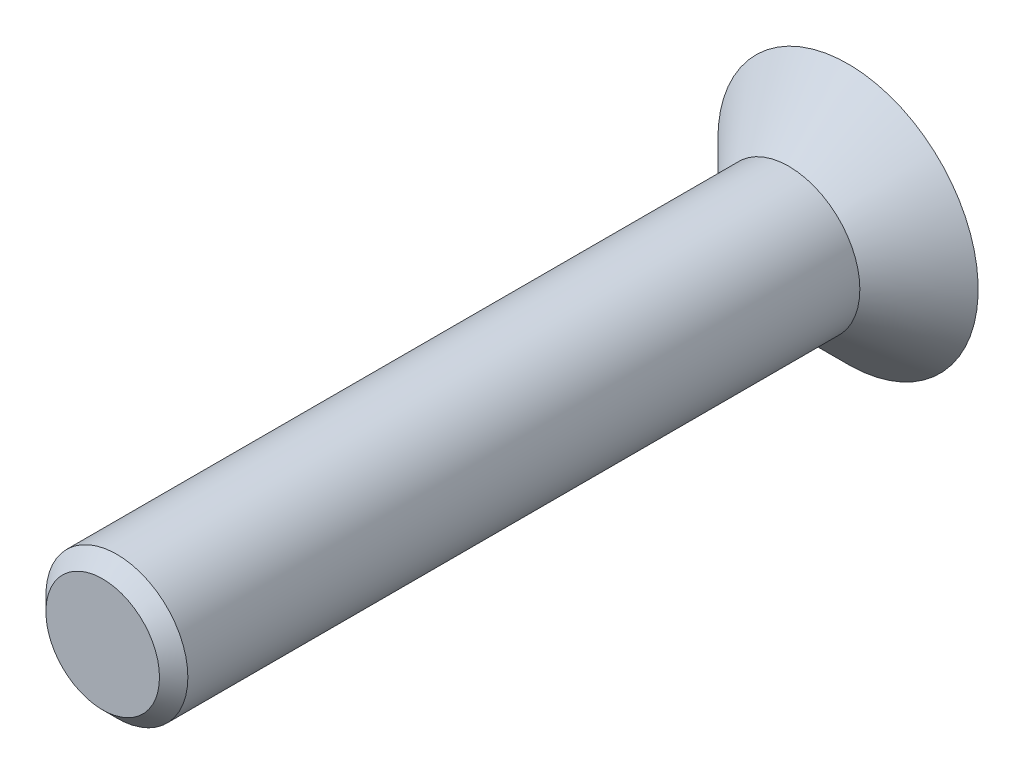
ISO-10303-21;
HEADER;
FILE_DESCRIPTION(('STEP AP214'),'2;1');
FILE_NAME('part.step','',(''),(''),'','','');
FILE_SCHEMA(('AUTOMOTIVE_DESIGN { 1 0 10303 214 1 1 1 1 }'));
ENDSEC;
DATA;
#1=APPLICATION_CONTEXT('core data for automotive mechanical design processes');
#2=APPLICATION_PROTOCOL_DEFINITION('international standard','automotive_design',2000,#1);
#3=PRODUCT_CONTEXT('',#1,'mechanical');
#4=PRODUCT('Part','Part','',(#3));
#5=PRODUCT_RELATED_PRODUCT_CATEGORY('part','',(#4));
#6=PRODUCT_DEFINITION_FORMATION('','',#4);
#7=PRODUCT_DEFINITION_CONTEXT('part definition',#1,'design');
#8=PRODUCT_DEFINITION('design','',#6,#7);
#9=PRODUCT_DEFINITION_SHAPE('','',#8);
#10=(LENGTH_UNIT() NAMED_UNIT(*) SI_UNIT(.MILLI.,.METRE.));
#11=(NAMED_UNIT(*) PLANE_ANGLE_UNIT() SI_UNIT($,.RADIAN.));
#12=(NAMED_UNIT(*) SI_UNIT($,.STERADIAN.) SOLID_ANGLE_UNIT());
#13=UNCERTAINTY_MEASURE_WITH_UNIT(LENGTH_MEASURE(1.E-05),#10,'distance_accuracy_value','');
#14=(GEOMETRIC_REPRESENTATION_CONTEXT(3) GLOBAL_UNCERTAINTY_ASSIGNED_CONTEXT((#13)) GLOBAL_UNIT_ASSIGNED_CONTEXT((#10,
#11,#12)) REPRESENTATION_CONTEXT('',''));
#15=CARTESIAN_POINT('',(0.,0.,0.));
#16=DIRECTION('',(0.,0.,1.));
#17=DIRECTION('',(1.,0.,0.));
#18=AXIS2_PLACEMENT_3D('',#15,#16,#17);
#19=CARTESIAN_POINT('',(0.,0.,-1.25));
#20=DIRECTION('',(0.,0.,1.));
#21=DIRECTION('',(1.,0.,0.));
#22=AXIS2_PLACEMENT_3D('',#19,#20,#21);
#23=PLANE('',#22);
#24=CARTESIAN_POINT('',(0.,0.,-1.25));
#25=DIRECTION('',(0.,0.,-1.));
#26=DIRECTION('',(-1.,0.,0.));
#27=AXIS2_PLACEMENT_3D('',#24,#25,#26);
#28=CIRCLE('',#27,2.75);
#29=CARTESIAN_POINT('',(-2.75,0.,-1.25));
#30=VERTEX_POINT('',#29);
#31=EDGE_CURVE('E84',#30,#30,#28,.T.);
#32=ORIENTED_EDGE('',*,*,#31,.T.);
#33=EDGE_LOOP('',(#32));
#34=FACE_BOUND('',#33,.T.);
#35=DIRECTION('',(-0.86602540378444,0.499999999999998,0.));
#36=VECTOR('',#35,1.);
#37=CARTESIAN_POINT('',(0.,1.15470053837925,-1.25));
#38=LINE('',#37,#36);
#39=CARTESIAN_POINT('',(1.,0.577350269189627,-1.25));
#40=VERTEX_POINT('',#39);
#41=CARTESIAN_POINT('',(0.,1.15470053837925,-1.25));
#42=VERTEX_POINT('',#41);
#43=EDGE_CURVE('E41',#40,#42,#38,.T.);
#44=ORIENTED_EDGE('',*,*,#43,.T.);
#45=DIRECTION('',(-0.866025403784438,-0.500000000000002,0.));
#46=VECTOR('',#45,1.);
#47=CARTESIAN_POINT('',(-1.,0.577350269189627,-1.25));
#48=LINE('',#47,#46);
#49=CARTESIAN_POINT('',(-1.,0.577350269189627,-1.25));
#50=VERTEX_POINT('',#49);
#51=EDGE_CURVE('E141',#42,#50,#48,.T.);
#52=ORIENTED_EDGE('',*,*,#51,.T.);
#53=DIRECTION('',(0.,-1.,0.));
#54=VECTOR('',#53,1.);
#55=CARTESIAN_POINT('',(-1.,-0.577350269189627,-1.25));
#56=LINE('',#55,#54);
#57=CARTESIAN_POINT('',(-1.,-0.577350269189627,-1.25));
#58=VERTEX_POINT('',#57);
#59=EDGE_CURVE('E144',#50,#58,#56,.T.);
#60=ORIENTED_EDGE('',*,*,#59,.T.);
#61=DIRECTION('',(0.866025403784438,-0.500000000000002,0.));
#62=VECTOR('',#61,1.);
#63=CARTESIAN_POINT('',(-1.,-0.577350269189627,-1.25));
#64=LINE('',#63,#62);
#65=CARTESIAN_POINT('',(0.,-1.15470053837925,-1.25));
#66=VERTEX_POINT('',#65);
#67=EDGE_CURVE('E150',#58,#66,#64,.T.);
#68=ORIENTED_EDGE('',*,*,#67,.T.);
#69=DIRECTION('',(0.86602540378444,0.499999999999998,0.));
#70=VECTOR('',#69,1.);
#71=CARTESIAN_POINT('',(0.,-1.15470053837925,-1.25));
#72=LINE('',#71,#70);
#73=CARTESIAN_POINT('',(1.,-0.577350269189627,-1.25));
#74=VERTEX_POINT('',#73);
#75=EDGE_CURVE('E153',#66,#74,#72,.T.);
#76=ORIENTED_EDGE('',*,*,#75,.T.);
#77=DIRECTION('',(0.,1.,0.));
#78=VECTOR('',#77,1.);
#79=CARTESIAN_POINT('',(1.,-0.577350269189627,-1.25));
#80=LINE('',#79,#78);
#81=EDGE_CURVE('E90',#74,#40,#80,.T.);
#82=ORIENTED_EDGE('',*,*,#81,.T.);
#83=EDGE_LOOP('',(#44,#52,#60,#68,#76,#82));
#84=FACE_BOUND('',#83,.T.);
#85=ADVANCED_FACE('F27',(#34,#84),#23,.F.);
#86=CARTESIAN_POINT('',(0.,0.,0.));
#87=DIRECTION('',(0.,0.,-1.));
#88=DIRECTION('',(-1.,0.,0.));
#89=AXIS2_PLACEMENT_3D('',#86,#87,#88);
#90=CONICAL_SURFACE('',#89,1.5,0.78539816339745);
#91=ORIENTED_EDGE('',*,*,#31,.F.);
#92=EDGE_LOOP('',(#91));
#93=FACE_BOUND('',#92,.T.);
#94=CARTESIAN_POINT('',(0.,0.,0.));
#95=DIRECTION('',(0.,0.,1.));
#96=DIRECTION('',(1.,0.,0.));
#97=AXIS2_PLACEMENT_3D('',#94,#95,#96);
#98=CIRCLE('',#97,1.5);
#99=CARTESIAN_POINT('',(1.5,0.,0.));
#100=VERTEX_POINT('',#99);
#101=EDGE_CURVE('E142',#100,#100,#98,.T.);
#102=ORIENTED_EDGE('',*,*,#101,.F.);
#103=EDGE_LOOP('',(#102));
#104=FACE_BOUND('',#103,.T.);
#105=ADVANCED_FACE('F128',(#93,#104),#90,.T.);
#106=CARTESIAN_POINT('',(0.,1.15470053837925,3.55));
#107=DIRECTION('',(-0.499999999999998,-0.86602540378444,0.));
#108=DIRECTION('',(0.86602540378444,-0.499999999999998,0.));
#109=AXIS2_PLACEMENT_3D('',#106,#107,#108);
#110=PLANE('',#109);
#111=DIRECTION('',(-0.86602540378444,0.499999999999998,0.));
#112=VECTOR('',#111,1.);
#113=CARTESIAN_POINT('',(0.499999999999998,0.86602540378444,0.));
#114=LINE('',#113,#112);
#115=CARTESIAN_POINT('',(1.,0.577350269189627,0.));
#116=VERTEX_POINT('',#115);
#117=CARTESIAN_POINT('',(0.,1.15470053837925,0.));
#118=VERTEX_POINT('',#117);
#119=EDGE_CURVE('E49',#116,#118,#114,.T.);
#120=ORIENTED_EDGE('',*,*,#119,.T.);
#121=DIRECTION('',(0.,0.,-1.));
#122=VECTOR('',#121,1.);
#123=CARTESIAN_POINT('',(0.,1.15470053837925,3.55));
#124=LINE('',#123,#122);
#125=EDGE_CURVE('E162',#118,#42,#124,.T.);
#126=ORIENTED_EDGE('',*,*,#125,.T.);
#127=ORIENTED_EDGE('',*,*,#43,.F.);
#128=DIRECTION('',(0.,0.,-1.));
#129=VECTOR('',#128,1.);
#130=CARTESIAN_POINT('',(1.,0.577350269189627,3.55));
#131=LINE('',#130,#129);
#132=EDGE_CURVE('E95',#116,#40,#131,.T.);
#133=ORIENTED_EDGE('',*,*,#132,.F.);
#134=EDGE_LOOP('',(#120,#126,#127,#133));
#135=FACE_BOUND('',#134,.T.);
#136=ADVANCED_FACE('F133',(#135),#110,.T.);
#137=CARTESIAN_POINT('',(-1.,0.577350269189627,3.55));
#138=DIRECTION('',(0.500000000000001,-0.866025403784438,0.));
#139=DIRECTION('',(0.866025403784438,0.500000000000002,0.));
#140=AXIS2_PLACEMENT_3D('',#137,#138,#139);
#141=PLANE('',#140);
#142=DIRECTION('',(-0.866025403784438,-0.500000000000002,0.));
#143=VECTOR('',#142,1.);
#144=CARTESIAN_POINT('',(-0.500000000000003,0.86602540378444,0.));
#145=LINE('',#144,#143);
#146=CARTESIAN_POINT('',(-1.,0.577350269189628,0.));
#147=VERTEX_POINT('',#146);
#148=EDGE_CURVE('E107',#118,#147,#145,.T.);
#149=ORIENTED_EDGE('',*,*,#148,.T.);
#150=DIRECTION('',(0.,0.,-1.));
#151=VECTOR('',#150,1.);
#152=CARTESIAN_POINT('',(-1.,0.577350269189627,3.55));
#153=LINE('',#152,#151);
#154=EDGE_CURVE('E160',#147,#50,#153,.T.);
#155=ORIENTED_EDGE('',*,*,#154,.T.);
#156=ORIENTED_EDGE('',*,*,#51,.F.);
#157=ORIENTED_EDGE('',*,*,#125,.F.);
#158=EDGE_LOOP('',(#149,#155,#156,#157));
#159=FACE_BOUND('',#158,.T.);
#160=ADVANCED_FACE('F165',(#159),#141,.T.);
#161=CARTESIAN_POINT('',(-1.,-0.577350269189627,3.55));
#162=DIRECTION('',(1.,0.,0.));
#163=DIRECTION('',(0.,0.,-1.));
#164=AXIS2_PLACEMENT_3D('',#161,#162,#163);
#165=PLANE('',#164);
#166=DIRECTION('',(0.,-1.,0.));
#167=VECTOR('',#166,1.);
#168=CARTESIAN_POINT('',(-1.,0.,0.));
#169=LINE('',#168,#167);
#170=CARTESIAN_POINT('',(-1.,-0.577350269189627,0.));
#171=VERTEX_POINT('',#170);
#172=EDGE_CURVE('E101',#147,#171,#169,.T.);
#173=ORIENTED_EDGE('',*,*,#172,.T.);
#174=DIRECTION('',(0.,0.,-1.));
#175=VECTOR('',#174,1.);
#176=CARTESIAN_POINT('',(-1.,-0.577350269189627,3.55));
#177=LINE('',#176,#175);
#178=EDGE_CURVE('E158',#171,#58,#177,.T.);
#179=ORIENTED_EDGE('',*,*,#178,.T.);
#180=ORIENTED_EDGE('',*,*,#59,.F.);
#181=ORIENTED_EDGE('',*,*,#154,.F.);
#182=EDGE_LOOP('',(#173,#179,#180,#181));
#183=FACE_BOUND('',#182,.T.);
#184=ADVANCED_FACE('F169',(#183),#165,.T.);
#185=CARTESIAN_POINT('',(-1.,-0.577350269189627,3.55));
#186=DIRECTION('',(0.500000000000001,0.866025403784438,0.));
#187=DIRECTION('',(-0.866025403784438,0.500000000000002,0.));
#188=AXIS2_PLACEMENT_3D('',#185,#186,#187);
#189=PLANE('',#188);
#190=DIRECTION('',(0.866025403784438,-0.500000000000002,0.));
#191=VECTOR('',#190,1.);
#192=CARTESIAN_POINT('',(-0.500000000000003,-0.86602540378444,0.));
#193=LINE('',#192,#191);
#194=CARTESIAN_POINT('',(0.,-1.15470053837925,0.));
#195=VERTEX_POINT('',#194);
#196=EDGE_CURVE('E99',#171,#195,#193,.T.);
#197=ORIENTED_EDGE('',*,*,#196,.T.);
#198=DIRECTION('',(0.,0.,-1.));
#199=VECTOR('',#198,1.);
#200=CARTESIAN_POINT('',(0.,-1.15470053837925,3.55));
#201=LINE('',#200,#199);
#202=EDGE_CURVE('E94',#195,#66,#201,.T.);
#203=ORIENTED_EDGE('',*,*,#202,.T.);
#204=ORIENTED_EDGE('',*,*,#67,.F.);
#205=ORIENTED_EDGE('',*,*,#178,.F.);
#206=EDGE_LOOP('',(#197,#203,#204,#205));
#207=FACE_BOUND('',#206,.T.);
#208=ADVANCED_FACE('F173',(#207),#189,.T.);
#209=CARTESIAN_POINT('',(0.,-1.15470053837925,3.55));
#210=DIRECTION('',(-0.499999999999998,0.86602540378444,0.));
#211=DIRECTION('',(-0.86602540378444,-0.499999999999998,0.));
#212=AXIS2_PLACEMENT_3D('',#209,#210,#211);
#213=PLANE('',#212);
#214=DIRECTION('',(0.86602540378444,0.499999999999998,0.));
#215=VECTOR('',#214,1.);
#216=CARTESIAN_POINT('',(0.499999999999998,-0.86602540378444,0.));
#217=LINE('',#216,#215);
#218=CARTESIAN_POINT('',(1.,-0.577350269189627,0.));
#219=VERTEX_POINT('',#218);
#220=EDGE_CURVE('E81',#195,#219,#217,.T.);
#221=ORIENTED_EDGE('',*,*,#220,.T.);
#222=DIRECTION('',(0.,0.,-1.));
#223=VECTOR('',#222,1.);
#224=CARTESIAN_POINT('',(1.,-0.577350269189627,3.55));
#225=LINE('',#224,#223);
#226=EDGE_CURVE('E87',#219,#74,#225,.T.);
#227=ORIENTED_EDGE('',*,*,#226,.T.);
#228=ORIENTED_EDGE('',*,*,#75,.F.);
#229=ORIENTED_EDGE('',*,*,#202,.F.);
#230=EDGE_LOOP('',(#221,#227,#228,#229));
#231=FACE_BOUND('',#230,.T.);
#232=ADVANCED_FACE('F98',(#231),#213,.T.);
#233=CARTESIAN_POINT('',(1.,-0.577350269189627,3.55));
#234=DIRECTION('',(-1.,0.,0.));
#235=DIRECTION('',(0.,0.,1.));
#236=AXIS2_PLACEMENT_3D('',#233,#234,#235);
#237=PLANE('',#236);
#238=DIRECTION('',(0.,1.,0.));
#239=VECTOR('',#238,1.);
#240=CARTESIAN_POINT('',(1.,0.,0.));
#241=LINE('',#240,#239);
#242=EDGE_CURVE('E77',#219,#116,#241,.T.);
#243=ORIENTED_EDGE('',*,*,#242,.T.);
#244=ORIENTED_EDGE('',*,*,#132,.T.);
#245=ORIENTED_EDGE('',*,*,#81,.F.);
#246=ORIENTED_EDGE('',*,*,#226,.F.);
#247=EDGE_LOOP('',(#243,#244,#245,#246));
#248=FACE_BOUND('',#247,.T.);
#249=ADVANCED_FACE('F88',(#248),#237,.T.);
#250=CARTESIAN_POINT('',(0.,0.,0.));
#251=DIRECTION('',(0.,0.,-1.));
#252=DIRECTION('',(-1.,0.,0.));
#253=AXIS2_PLACEMENT_3D('',#250,#251,#252);
#254=PLANE('',#253);
#255=ORIENTED_EDGE('',*,*,#148,.F.);
#256=ORIENTED_EDGE('',*,*,#119,.F.);
#257=ORIENTED_EDGE('',*,*,#242,.F.);
#258=ORIENTED_EDGE('',*,*,#220,.F.);
#259=ORIENTED_EDGE('',*,*,#196,.F.);
#260=ORIENTED_EDGE('',*,*,#172,.F.);
#261=EDGE_LOOP('',(#255,#256,#257,#258,#259,#260));
#262=FACE_BOUND('',#261,.T.);
#263=ADVANCED_FACE('F79',(#262),#254,.T.);
#264=CARTESIAN_POINT('',(0.,0.,14.5));
#265=DIRECTION('',(0.,0.,1.));
#266=DIRECTION('',(1.,0.,0.));
#267=AXIS2_PLACEMENT_3D('',#264,#265,#266);
#268=PLANE('',#267);
#269=CARTESIAN_POINT('',(0.,0.,14.5));
#270=DIRECTION('',(0.,0.,1.));
#271=DIRECTION('',(1.,0.,0.));
#272=AXIS2_PLACEMENT_3D('',#269,#270,#271);
#273=CIRCLE('',#272,1.19999999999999);
#274=CARTESIAN_POINT('',(1.2,0.,14.5));
#275=VERTEX_POINT('',#274);
#276=EDGE_CURVE('E34',#275,#275,#273,.T.);
#277=ORIENTED_EDGE('',*,*,#276,.T.);
#278=EDGE_LOOP('',(#277));
#279=FACE_BOUND('',#278,.T.);
#280=ADVANCED_FACE('F113',(#279),#268,.T.);
#281=CARTESIAN_POINT('',(0.,0.,0.));
#282=DIRECTION('',(0.,0.,1.));
#283=DIRECTION('',(1.,0.,0.));
#284=AXIS2_PLACEMENT_3D('',#281,#282,#283);
#285=CYLINDRICAL_SURFACE('',#284,1.5);
#286=CARTESIAN_POINT('',(0.,0.,14.2));
#287=DIRECTION('',(0.,0.,1.));
#288=DIRECTION('',(1.,0.,0.));
#289=AXIS2_PLACEMENT_3D('',#286,#287,#288);
#290=CIRCLE('',#289,1.5);
#291=CARTESIAN_POINT('',(1.5,0.,14.2));
#292=VERTEX_POINT('',#291);
#293=EDGE_CURVE('E11',#292,#292,#290,.F.);
#294=ORIENTED_EDGE('',*,*,#293,.T.);
#295=EDGE_LOOP('',(#294));
#296=FACE_BOUND('',#295,.T.);
#297=ORIENTED_EDGE('',*,*,#101,.T.);
#298=EDGE_LOOP('',(#297));
#299=FACE_BOUND('',#298,.T.);
#300=ADVANCED_FACE('F117',(#296,#299),#285,.T.);
#301=CARTESIAN_POINT('',(0.,0.,14.5));
#302=DIRECTION('',(0.,0.,-1.));
#303=DIRECTION('',(-1.,0.,0.));
#304=AXIS2_PLACEMENT_3D('',#301,#302,#303);
#305=CONICAL_SURFACE('',#304,1.19999999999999,0.785398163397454);
#306=ORIENTED_EDGE('',*,*,#293,.F.);
#307=EDGE_LOOP('',(#306));
#308=FACE_BOUND('',#307,.T.);
#309=ORIENTED_EDGE('',*,*,#276,.F.);
#310=EDGE_LOOP('',(#309));
#311=FACE_BOUND('',#310,.T.);
#312=ADVANCED_FACE('F115',(#308,#311),#305,.T.);
#313=CLOSED_SHELL('',(#85,#105,#136,#160,#184,#208,#232,#249,#263,#280,#300,#312));
#314=MANIFOLD_SOLID_BREP('B2',#313);
#315=ADVANCED_BREP_SHAPE_REPRESENTATION('',(#18,#314),#14);
#316=SHAPE_DEFINITION_REPRESENTATION(#9,#315);
ENDSEC;
END-ISO-10303-21;
